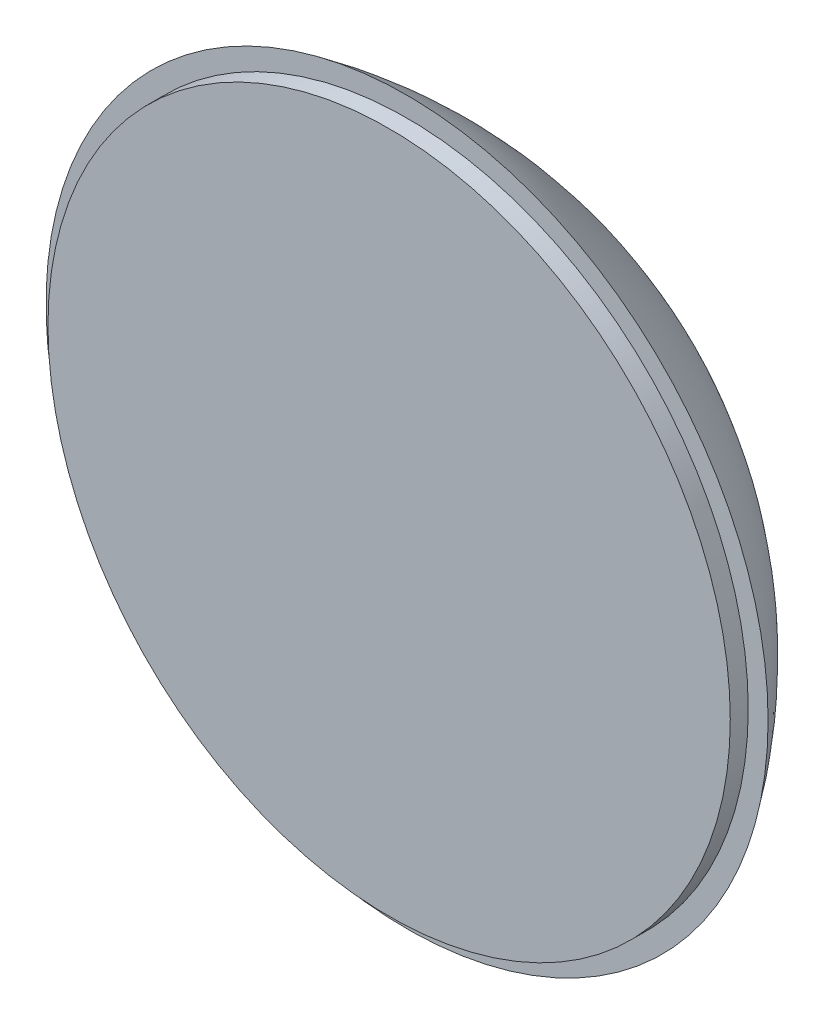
ISO-10303-21;
HEADER;
FILE_DESCRIPTION(('STEP AP214'),'2;1');
FILE_NAME('part.step','',(''),(''),'','','');
FILE_SCHEMA(('AUTOMOTIVE_DESIGN { 1 0 10303 214 1 1 1 1 }'));
ENDSEC;
DATA;
#1=APPLICATION_CONTEXT('core data for automotive mechanical design processes');
#2=APPLICATION_PROTOCOL_DEFINITION('international standard','automotive_design',2000,#1);
#3=PRODUCT_CONTEXT('',#1,'mechanical');
#4=PRODUCT('Part','Part','',(#3));
#5=PRODUCT_RELATED_PRODUCT_CATEGORY('part','',(#4));
#6=PRODUCT_DEFINITION_FORMATION('','',#4);
#7=PRODUCT_DEFINITION_CONTEXT('part definition',#1,'design');
#8=PRODUCT_DEFINITION('design','',#6,#7);
#9=PRODUCT_DEFINITION_SHAPE('','',#8);
#10=(LENGTH_UNIT() NAMED_UNIT(*) SI_UNIT(.MILLI.,.METRE.));
#11=(NAMED_UNIT(*) PLANE_ANGLE_UNIT() SI_UNIT($,.RADIAN.));
#12=(NAMED_UNIT(*) SI_UNIT($,.STERADIAN.) SOLID_ANGLE_UNIT());
#13=UNCERTAINTY_MEASURE_WITH_UNIT(LENGTH_MEASURE(1.E-05),#10,'distance_accuracy_value','');
#14=(GEOMETRIC_REPRESENTATION_CONTEXT(3) GLOBAL_UNCERTAINTY_ASSIGNED_CONTEXT((#13)) GLOBAL_UNIT_ASSIGNED_CONTEXT((#10,
#11,#12)) REPRESENTATION_CONTEXT('',''));
#15=CARTESIAN_POINT('',(0.,0.,0.));
#16=DIRECTION('',(0.,0.,1.));
#17=DIRECTION('',(1.,0.,0.));
#18=AXIS2_PLACEMENT_3D('',#15,#16,#17);
#19=CARTESIAN_POINT('',(0.,0.,26.));
#20=DIRECTION('',(0.,0.,1.));
#21=DIRECTION('',(1.,0.,0.));
#22=AXIS2_PLACEMENT_3D('',#19,#20,#21);
#23=SPHERICAL_SURFACE('',#22,49.);
#24=CARTESIAN_POINT('',(-2.33303726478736,0.,27.8859843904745));
#25=DIRECTION('',(-0.777679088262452,0.,0.628661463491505));
#26=DIRECTION('',(0.628661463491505,0.,0.777679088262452));
#27=AXIS2_PLACEMENT_3D('',#24,#25,#26);
#28=CIRCLE('',#27,48.9080770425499);
#29=CARTESIAN_POINT('',(-32.9421415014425,-4.62053381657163,-9.97868786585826));
#30=VERTEX_POINT('',#29);
#31=CARTESIAN_POINT('',(-32.9421415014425,4.62053381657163,-9.97868786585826));
#32=VERTEX_POINT('',#31);
#33=EDGE_CURVE('E11',#30,#32,#28,.F.);
#34=ORIENTED_EDGE('',*,*,#33,.F.);
#35=CARTESIAN_POINT('',(0.,-4.62053381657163,26.));
#36=DIRECTION('',(0.,-1.,0.));
#37=DIRECTION('',(0.,0.,-1.));
#38=AXIS2_PLACEMENT_3D('',#35,#36,#37);
#39=CIRCLE('',#38,48.7816632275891);
#40=CARTESIAN_POINT('',(-3.,-4.62053381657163,-22.6893280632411));
#41=VERTEX_POINT('',#40);
#42=EDGE_CURVE('E78',#41,#30,#39,.F.);
#43=ORIENTED_EDGE('',*,*,#42,.F.);
#44=CARTESIAN_POINT('',(-3.,0.,26.));
#45=DIRECTION('',(-1.,0.,0.));
#46=DIRECTION('',(0.,0.,1.));
#47=AXIS2_PLACEMENT_3D('',#44,#45,#46);
#48=CIRCLE('',#47,48.9080770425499);
#49=CARTESIAN_POINT('',(-3.,4.62053381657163,-22.6893280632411));
#50=VERTEX_POINT('',#49);
#51=EDGE_CURVE('E73',#41,#50,#48,.F.);
#52=ORIENTED_EDGE('',*,*,#51,.T.);
#53=CARTESIAN_POINT('',(0.,4.62053381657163,26.));
#54=DIRECTION('',(0.,-1.,0.));
#55=DIRECTION('',(0.,0.,-1.));
#56=AXIS2_PLACEMENT_3D('',#53,#54,#55);
#57=CIRCLE('',#56,48.7816632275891);
#58=EDGE_CURVE('E43',#32,#50,#57,.T.);
#59=ORIENTED_EDGE('',*,*,#58,.F.);
#60=EDGE_LOOP('',(#34,#43,#52,#59));
#61=FACE_BOUND('',#60,.T.);
#62=CARTESIAN_POINT('',(2.33303726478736,0.,27.8859843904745));
#63=DIRECTION('',(0.777679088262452,0.,0.628661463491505));
#64=DIRECTION('',(0.628661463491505,0.,-0.777679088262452));
#65=AXIS2_PLACEMENT_3D('',#62,#63,#64);
#66=CIRCLE('',#65,48.9080770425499);
#67=CARTESIAN_POINT('',(32.9421415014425,4.62053381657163,-9.97868786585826));
#68=VERTEX_POINT('',#67);
#69=CARTESIAN_POINT('',(32.9421415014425,-4.62053381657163,-9.97868786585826));
#70=VERTEX_POINT('',#69);
#71=EDGE_CURVE('E79',#68,#70,#66,.F.);
#72=ORIENTED_EDGE('',*,*,#71,.F.);
#73=CARTESIAN_POINT('',(0.,4.62053381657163,26.));
#74=DIRECTION('',(0.,1.,0.));
#75=DIRECTION('',(0.,0.,1.));
#76=AXIS2_PLACEMENT_3D('',#73,#74,#75);
#77=CIRCLE('',#76,48.7816632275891);
#78=CARTESIAN_POINT('',(3.,4.62053381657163,-22.6893280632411));
#79=VERTEX_POINT('',#78);
#80=EDGE_CURVE('E92',#68,#79,#77,.T.);
#81=ORIENTED_EDGE('',*,*,#80,.T.);
#82=CARTESIAN_POINT('',(3.,0.,26.));
#83=DIRECTION('',(1.,0.,0.));
#84=DIRECTION('',(0.,0.,-1.));
#85=AXIS2_PLACEMENT_3D('',#82,#83,#84);
#86=CIRCLE('',#85,48.9080770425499);
#87=CARTESIAN_POINT('',(3.,-4.62053381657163,-22.6893280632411));
#88=VERTEX_POINT('',#87);
#89=EDGE_CURVE('E98',#79,#88,#86,.F.);
#90=ORIENTED_EDGE('',*,*,#89,.T.);
#91=CARTESIAN_POINT('',(0.,-4.62053381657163,26.));
#92=DIRECTION('',(0.,1.,0.));
#93=DIRECTION('',(0.,0.,1.));
#94=AXIS2_PLACEMENT_3D('',#91,#92,#93);
#95=CIRCLE('',#94,48.7816632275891);
#96=EDGE_CURVE('E95',#88,#70,#95,.F.);
#97=ORIENTED_EDGE('',*,*,#96,.T.);
#98=EDGE_LOOP('',(#72,#81,#90,#97));
#99=FACE_BOUND('',#98,.T.);
#100=CARTESIAN_POINT('',(0.,0.,-2.));
#101=DIRECTION('',(0.,0.,1.));
#102=DIRECTION('',(1.,0.,0.));
#103=AXIS2_PLACEMENT_3D('',#100,#101,#102);
#104=CIRCLE('',#103,40.2119385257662);
#105=CARTESIAN_POINT('',(40.2119385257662,0.,-2.));
#106=VERTEX_POINT('',#105);
#107=EDGE_CURVE('E101',#106,#106,#104,.T.);
#108=ORIENTED_EDGE('',*,*,#107,.F.);
#109=EDGE_LOOP('',(#108));
#110=FACE_BOUND('',#109,.T.);
#111=ADVANCED_FACE('F36',(#61,#99,#110),#23,.T.);
#112=CARTESIAN_POINT('',(38.,0.,-2.));
#113=DIRECTION('',(0.,0.,1.));
#114=DIRECTION('',(1.,0.,0.));
#115=AXIS2_PLACEMENT_3D('',#112,#113,#114);
#116=PLANE('',#115);
#117=ORIENTED_EDGE('',*,*,#107,.T.);
#118=EDGE_LOOP('',(#117));
#119=FACE_BOUND('',#118,.T.);
#120=CARTESIAN_POINT('',(0.,0.,-2.));
#121=DIRECTION('',(0.,0.,1.));
#122=DIRECTION('',(1.,0.,0.));
#123=AXIS2_PLACEMENT_3D('',#120,#121,#122);
#124=CIRCLE('',#123,38.);
#125=CARTESIAN_POINT('',(38.,0.,-2.));
#126=VERTEX_POINT('',#125);
#127=EDGE_CURVE('E104',#126,#126,#124,.T.);
#128=ORIENTED_EDGE('',*,*,#127,.F.);
#129=EDGE_LOOP('',(#128));
#130=FACE_BOUND('',#129,.T.);
#131=ADVANCED_FACE('F129',(#119,#130),#116,.T.);
#132=CARTESIAN_POINT('',(0.,0.,0.));
#133=DIRECTION('',(0.,0.,1.));
#134=DIRECTION('',(1.,0.,0.));
#135=AXIS2_PLACEMENT_3D('',#132,#133,#134);
#136=CYLINDRICAL_SURFACE('',#135,38.);
#137=ORIENTED_EDGE('',*,*,#127,.T.);
#138=EDGE_LOOP('',(#137));
#139=FACE_BOUND('',#138,.T.);
#140=CARTESIAN_POINT('',(0.,0.,0.));
#141=DIRECTION('',(0.,0.,1.));
#142=DIRECTION('',(1.,0.,0.));
#143=AXIS2_PLACEMENT_3D('',#140,#141,#142);
#144=CIRCLE('',#143,38.);
#145=CARTESIAN_POINT('',(38.,0.,0.));
#146=VERTEX_POINT('',#145);
#147=EDGE_CURVE('E107',#146,#146,#144,.T.);
#148=ORIENTED_EDGE('',*,*,#147,.F.);
#149=EDGE_LOOP('',(#148));
#150=FACE_BOUND('',#149,.T.);
#151=ADVANCED_FACE('F126',(#139,#150),#136,.T.);
#152=CARTESIAN_POINT('',(0.,0.,0.));
#153=DIRECTION('',(0.,0.,1.));
#154=DIRECTION('',(1.,0.,0.));
#155=AXIS2_PLACEMENT_3D('',#152,#153,#154);
#156=PLANE('',#155);
#157=ORIENTED_EDGE('',*,*,#147,.T.);
#158=EDGE_LOOP('',(#157));
#159=FACE_BOUND('',#158,.T.);
#160=ADVANCED_FACE('F121',(#159),#156,.T.);
#161=CARTESIAN_POINT('',(34.1433073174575,0.,-11.4645774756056));
#162=DIRECTION('',(0.777679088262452,0.,0.628661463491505));
#163=DIRECTION('',(0.628661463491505,0.,-0.777679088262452));
#164=AXIS2_PLACEMENT_3D('',#161,#162,#163);
#165=CIRCLE('',#164,5.);
#166=CARTESIAN_POINT('',(0.,0.,26.));
#167=DIRECTION('',(0.,1.,0.));
#168=AXIS1_PLACEMENT('',#166,#167);
#169=SURFACE_OF_REVOLUTION('',#165,#168);
#170=EDGE_CURVE('E110',#68,#70,#165,.T.);
#171=ORIENTED_EDGE('',*,*,#170,.T.);
#172=ORIENTED_EDGE('',*,*,#96,.F.);
#173=CARTESIAN_POINT('',(3.,0.,-24.6));
#174=DIRECTION('',(1.,0.,0.));
#175=DIRECTION('',(0.,0.,-1.));
#176=AXIS2_PLACEMENT_3D('',#173,#174,#175);
#177=CIRCLE('',#176,5.);
#178=EDGE_CURVE('E56',#79,#88,#177,.T.);
#179=ORIENTED_EDGE('',*,*,#178,.F.);
#180=ORIENTED_EDGE('',*,*,#80,.F.);
#181=EDGE_LOOP('',(#171,#172,#179,#180));
#182=FACE_BOUND('',#181,.T.);
#183=ADVANCED_FACE('F116',(#182),#169,.F.);
#184=CARTESIAN_POINT('',(34.1433073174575,0.,-11.4645774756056));
#185=DIRECTION('',(0.777679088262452,0.,0.628661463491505));
#186=DIRECTION('',(0.628661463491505,0.,-0.777679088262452));
#187=AXIS2_PLACEMENT_3D('',#184,#185,#186);
#188=PLANE('',#187);
#189=ORIENTED_EDGE('',*,*,#71,.T.);
#190=ORIENTED_EDGE('',*,*,#170,.F.);
#191=EDGE_LOOP('',(#189,#190));
#192=FACE_BOUND('',#191,.T.);
#193=ADVANCED_FACE('F120',(#192),#188,.F.);
#194=CARTESIAN_POINT('',(3.,0.,-24.6));
#195=DIRECTION('',(1.,0.,0.));
#196=DIRECTION('',(0.,0.,-1.));
#197=AXIS2_PLACEMENT_3D('',#194,#195,#196);
#198=PLANE('',#197);
#199=ORIENTED_EDGE('',*,*,#178,.T.);
#200=ORIENTED_EDGE('',*,*,#89,.F.);
#201=EDGE_LOOP('',(#199,#200));
#202=FACE_BOUND('',#201,.T.);
#203=ADVANCED_FACE('F151',(#202),#198,.T.);
#204=CARTESIAN_POINT('',(-34.1433073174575,0.,-11.4645774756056));
#205=DIRECTION('',(0.777679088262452,0.,-0.628661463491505));
#206=DIRECTION('',(-0.628661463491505,0.,-0.777679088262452));
#207=AXIS2_PLACEMENT_3D('',#204,#205,#206);
#208=CIRCLE('',#207,5.);
#209=CARTESIAN_POINT('',(0.,0.,26.));
#210=DIRECTION('',(0.,-1.,0.));
#211=AXIS1_PLACEMENT('',#209,#210);
#212=SURFACE_OF_REVOLUTION('',#208,#211);
#213=ORIENTED_EDGE('',*,*,#58,.T.);
#214=CARTESIAN_POINT('',(-3.,0.,-24.6));
#215=DIRECTION('',(1.,0.,0.));
#216=DIRECTION('',(0.,0.,-1.));
#217=AXIS2_PLACEMENT_3D('',#214,#215,#216);
#218=CIRCLE('',#217,5.);
#219=EDGE_CURVE('E49',#50,#41,#218,.T.);
#220=ORIENTED_EDGE('',*,*,#219,.T.);
#221=ORIENTED_EDGE('',*,*,#42,.T.);
#222=EDGE_CURVE('E85',#32,#30,#208,.T.);
#223=ORIENTED_EDGE('',*,*,#222,.F.);
#224=EDGE_LOOP('',(#213,#220,#221,#223));
#225=FACE_BOUND('',#224,.T.);
#226=ADVANCED_FACE('F82',(#225),#212,.T.);
#227=CARTESIAN_POINT('',(-34.1433073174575,0.,-11.4645774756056));
#228=DIRECTION('',(-0.777679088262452,0.,0.628661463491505));
#229=DIRECTION('',(-0.628661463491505,0.,-0.777679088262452));
#230=AXIS2_PLACEMENT_3D('',#227,#228,#229);
#231=PLANE('',#230);
#232=ORIENTED_EDGE('',*,*,#33,.T.);
#233=ORIENTED_EDGE('',*,*,#222,.T.);
#234=EDGE_LOOP('',(#232,#233));
#235=FACE_BOUND('',#234,.T.);
#236=ADVANCED_FACE('F161',(#235),#231,.F.);
#237=CARTESIAN_POINT('',(-3.,0.,-24.6));
#238=DIRECTION('',(-1.,0.,0.));
#239=DIRECTION('',(0.,0.,-1.));
#240=AXIS2_PLACEMENT_3D('',#237,#238,#239);
#241=PLANE('',#240);
#242=ORIENTED_EDGE('',*,*,#219,.F.);
#243=ORIENTED_EDGE('',*,*,#51,.F.);
#244=EDGE_LOOP('',(#242,#243));
#245=FACE_BOUND('',#244,.T.);
#246=ADVANCED_FACE('F74',(#245),#241,.T.);
#247=CLOSED_SHELL('',(#111,#131,#151,#160,#183,#193,#203,#226,#236,#246));
#248=MANIFOLD_SOLID_BREP('B2',#247);
#249=ADVANCED_BREP_SHAPE_REPRESENTATION('',(#18,#248),#14);
#250=SHAPE_DEFINITION_REPRESENTATION(#9,#249);
ENDSEC;
END-ISO-10303-21;
